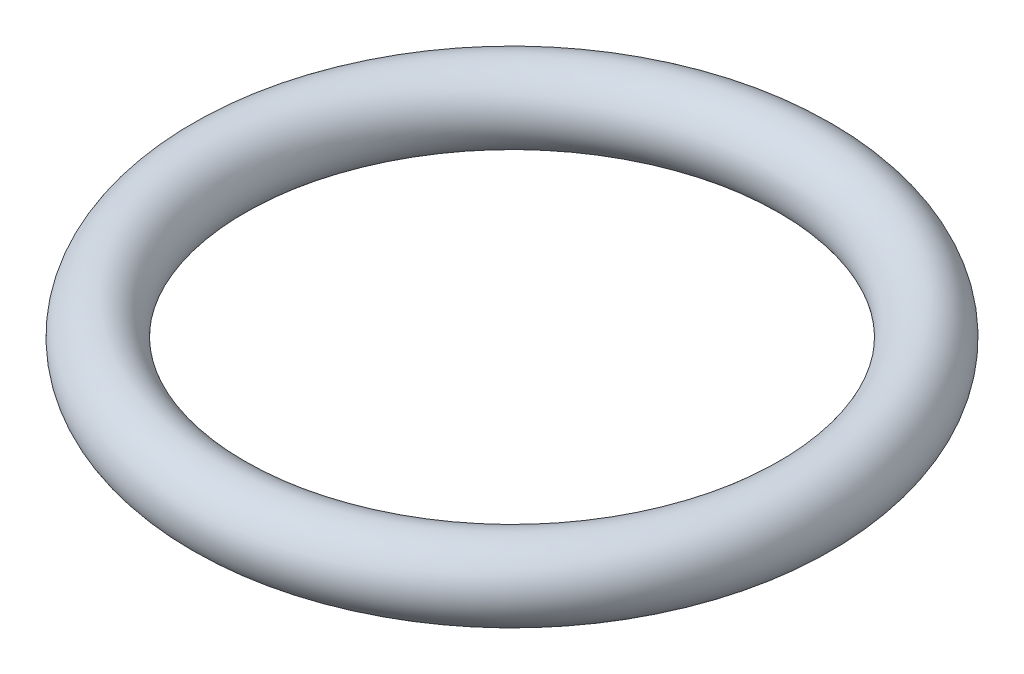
from build123d import *

# Parameters (mm, degrees)
ESQUISSE1_R = 1.5


with BuildPart() as part:
    # Esquisse1 → Base-R_volution (revolve)
    with BuildSketch(Plane.XY, mode=Mode.PRIVATE) as base_r_volution_sk:
        with Locations((-12, 1.5)):
            Circle(ESQUISSE1_R)
    revolve(base_r_volution_sk.sketch.rotate(Axis((0, 0, 0), (0, 1, 0)), 270), axis=Axis((0, 0, 0), (0, 1, 0)))


solid = part.part
